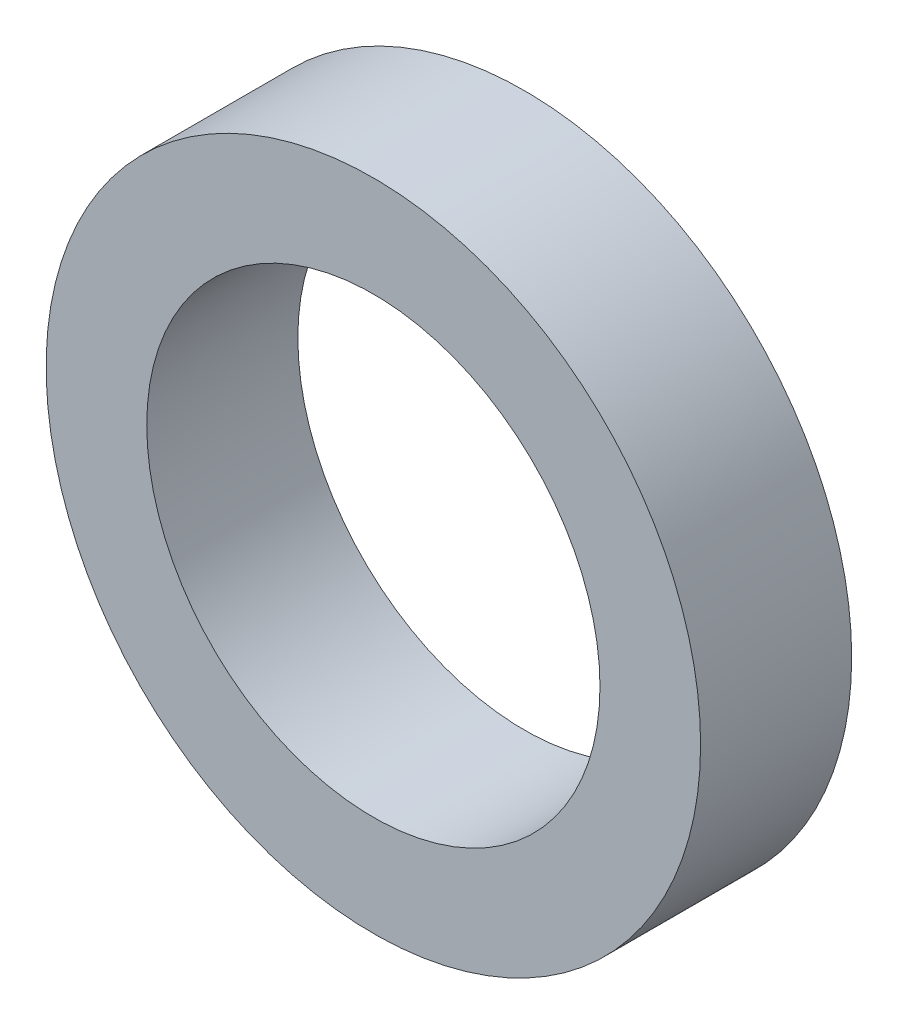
ISO-10303-21;
HEADER;
FILE_DESCRIPTION(('STEP AP214'),'2;1');
FILE_NAME('part.step','',(''),(''),'','','');
FILE_SCHEMA(('AUTOMOTIVE_DESIGN { 1 0 10303 214 1 1 1 1 }'));
ENDSEC;
DATA;
#1=APPLICATION_CONTEXT('core data for automotive mechanical design processes');
#2=APPLICATION_PROTOCOL_DEFINITION('international standard','automotive_design',2000,#1);
#3=PRODUCT_CONTEXT('',#1,'mechanical');
#4=PRODUCT('Part','Part','',(#3));
#5=PRODUCT_RELATED_PRODUCT_CATEGORY('part','',(#4));
#6=PRODUCT_DEFINITION_FORMATION('','',#4);
#7=PRODUCT_DEFINITION_CONTEXT('part definition',#1,'design');
#8=PRODUCT_DEFINITION('design','',#6,#7);
#9=PRODUCT_DEFINITION_SHAPE('','',#8);
#10=(LENGTH_UNIT() NAMED_UNIT(*) SI_UNIT(.MILLI.,.METRE.));
#11=(NAMED_UNIT(*) PLANE_ANGLE_UNIT() SI_UNIT($,.RADIAN.));
#12=(NAMED_UNIT(*) SI_UNIT($,.STERADIAN.) SOLID_ANGLE_UNIT());
#13=UNCERTAINTY_MEASURE_WITH_UNIT(LENGTH_MEASURE(1.E-05),#10,'distance_accuracy_value','');
#14=(GEOMETRIC_REPRESENTATION_CONTEXT(3) GLOBAL_UNCERTAINTY_ASSIGNED_CONTEXT((#13)) GLOBAL_UNIT_ASSIGNED_CONTEXT((#10,
#11,#12)) REPRESENTATION_CONTEXT('',''));
#15=CARTESIAN_POINT('',(0.,0.,0.));
#16=DIRECTION('',(0.,0.,1.));
#17=DIRECTION('',(1.,0.,0.));
#18=AXIS2_PLACEMENT_3D('',#15,#16,#17);
#19=CARTESIAN_POINT('',(0.,0.,38.1));
#20=DIRECTION('',(0.,0.,-1.));
#21=DIRECTION('',(-1.,0.,0.));
#22=AXIS2_PLACEMENT_3D('',#19,#20,#21);
#23=CYLINDRICAL_SURFACE('',#22,82.5246);
#24=CARTESIAN_POINT('',(0.,0.,38.1));
#25=DIRECTION('',(0.,0.,1.));
#26=DIRECTION('',(1.,0.,0.));
#27=AXIS2_PLACEMENT_3D('',#24,#25,#26);
#28=CIRCLE('',#27,82.5246);
#29=CARTESIAN_POINT('',(82.5246,0.,38.1));
#30=VERTEX_POINT('',#29);
#31=EDGE_CURVE('E10',#30,#30,#28,.T.);
#32=ORIENTED_EDGE('',*,*,#31,.F.);
#33=EDGE_LOOP('',(#32));
#34=FACE_BOUND('',#33,.T.);
#35=CARTESIAN_POINT('',(0.,0.,0.));
#36=DIRECTION('',(0.,0.,1.));
#37=DIRECTION('',(1.,0.,0.));
#38=AXIS2_PLACEMENT_3D('',#35,#36,#37);
#39=CIRCLE('',#38,82.5246);
#40=CARTESIAN_POINT('',(82.5246,0.,0.));
#41=VERTEX_POINT('',#40);
#42=EDGE_CURVE('E44',#41,#41,#39,.T.);
#43=ORIENTED_EDGE('',*,*,#42,.T.);
#44=EDGE_LOOP('',(#43));
#45=FACE_BOUND('',#44,.T.);
#46=ADVANCED_FACE('F41',(#34,#45),#23,.T.);
#47=CARTESIAN_POINT('',(0.,0.,38.1));
#48=DIRECTION('',(0.,0.,1.));
#49=DIRECTION('',(1.,0.,0.));
#50=AXIS2_PLACEMENT_3D('',#47,#48,#49);
#51=PLANE('',#50);
#52=CARTESIAN_POINT('',(0.,0.,38.1));
#53=DIRECTION('',(0.,0.,1.));
#54=DIRECTION('',(1.,0.,0.));
#55=AXIS2_PLACEMENT_3D('',#52,#53,#54);
#56=CIRCLE('',#55,57.15);
#57=CARTESIAN_POINT('',(57.15,0.,38.1));
#58=VERTEX_POINT('',#57);
#59=EDGE_CURVE('E51',#58,#58,#56,.T.);
#60=ORIENTED_EDGE('',*,*,#59,.F.);
#61=EDGE_LOOP('',(#60));
#62=FACE_BOUND('',#61,.T.);
#63=ORIENTED_EDGE('',*,*,#31,.T.);
#64=EDGE_LOOP('',(#63));
#65=FACE_BOUND('',#64,.T.);
#66=ADVANCED_FACE('F62',(#62,#65),#51,.T.);
#67=CARTESIAN_POINT('',(0.,0.,0.));
#68=DIRECTION('',(0.,0.,1.));
#69=DIRECTION('',(1.,0.,0.));
#70=AXIS2_PLACEMENT_3D('',#67,#68,#69);
#71=PLANE('',#70);
#72=CARTESIAN_POINT('',(0.,0.,0.));
#73=DIRECTION('',(0.,0.,1.));
#74=DIRECTION('',(1.,0.,0.));
#75=AXIS2_PLACEMENT_3D('',#72,#73,#74);
#76=CIRCLE('',#75,57.15);
#77=CARTESIAN_POINT('',(57.15,0.,0.));
#78=VERTEX_POINT('',#77);
#79=EDGE_CURVE('E53',#78,#78,#76,.T.);
#80=ORIENTED_EDGE('',*,*,#79,.T.);
#81=EDGE_LOOP('',(#80));
#82=FACE_BOUND('',#81,.T.);
#83=ORIENTED_EDGE('',*,*,#42,.F.);
#84=EDGE_LOOP('',(#83));
#85=FACE_BOUND('',#84,.T.);
#86=ADVANCED_FACE('F64',(#82,#85),#71,.F.);
#87=CARTESIAN_POINT('',(0.,0.,38.1));
#88=DIRECTION('',(0.,0.,-1.));
#89=DIRECTION('',(-1.,0.,0.));
#90=AXIS2_PLACEMENT_3D('',#87,#88,#89);
#91=CYLINDRICAL_SURFACE('',#90,57.15);
#92=ORIENTED_EDGE('',*,*,#59,.T.);
#93=EDGE_LOOP('',(#92));
#94=FACE_BOUND('',#93,.T.);
#95=ORIENTED_EDGE('',*,*,#79,.F.);
#96=EDGE_LOOP('',(#95));
#97=FACE_BOUND('',#96,.T.);
#98=ADVANCED_FACE('F59',(#94,#97),#91,.F.);
#99=CLOSED_SHELL('',(#46,#66,#86,#98));
#100=MANIFOLD_SOLID_BREP('B2',#99);
#101=ADVANCED_BREP_SHAPE_REPRESENTATION('',(#18,#100),#14);
#102=SHAPE_DEFINITION_REPRESENTATION(#9,#101);
ENDSEC;
END-ISO-10303-21;
